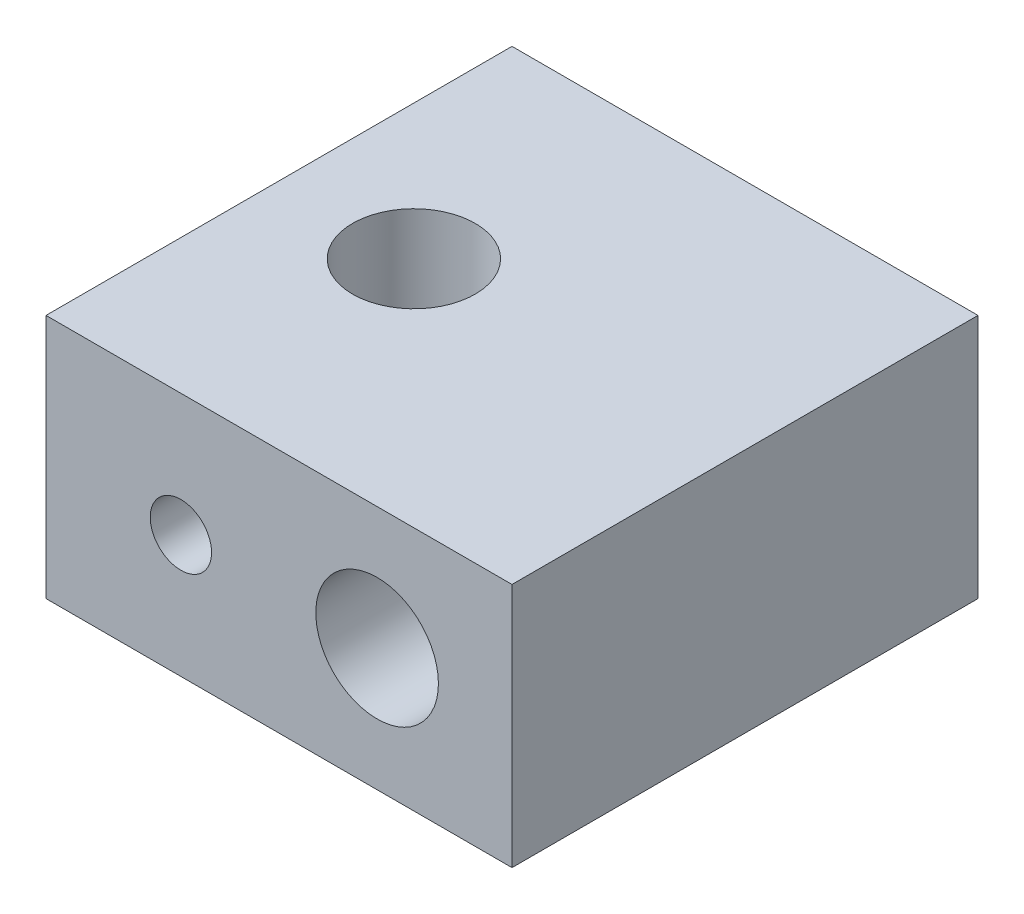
from build123d import *

# Parameters (mm, degrees)
SKETCH1_W           = 19
SKETCH1_H           = 19
BOSS_EXTRUDE1_DEPTH = 10
SKETCH2_R           = 2.5
CUT_EXTRUDE1_DEPTH  = 17.748134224
SKETCH3_R           = 1.25
CUT_EXTRUDE2_DEPTH  = 5
SKETCH4_R           = 2.5
CUT_EXTRUDE3_DEPTH  = 24.478713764
SKETCH5_R           = 3.25
CUT_EXTRUDE4_DEPTH  = 1.5
SKETCH6_R           = 1.25
CUT_EXTRUDE5_DEPTH  = 5


with BuildPart() as part:
    # Sketch1 → Boss-Extrude1 (new body)
    with BuildSketch(Plane(origin=(0, 0, 0), x_dir=(1, 0, 0), z_dir=(0, 1, 0))):
        Rectangle(SKETCH1_W, SKETCH1_H)
    extrude(amount=BOSS_EXTRUDE1_DEPTH)

    # Sketch2 → Cut-Extrude1 (cut, through all)
    with BuildSketch(Plane(origin=(0, 10, 0), x_dir=(1, 0, 0), z_dir=(0, 1, 0))):
        with Locations(Location((-4, 0, 0), (0, 0, 270))):
            Circle(SKETCH2_R)
    extrude(amount=-CUT_EXTRUDE1_DEPTH, mode=Mode.SUBTRACT)

    # Sketch3 → Cut-Extrude2 (cut)
    with BuildSketch(Plane.XY.offset(9.5)):
        with Locations((-4, 5)):
            Circle(SKETCH3_R)
    extrude(amount=-CUT_EXTRUDE2_DEPTH, mode=Mode.SUBTRACT)

    # Sketch4 → Cut-Extrude3 (cut, through all)
    with BuildSketch(Plane.XY.offset(9.5)):
        with Locations((4, 5)):
            Circle(SKETCH4_R)
    extrude(amount=-CUT_EXTRUDE3_DEPTH, mode=Mode.SUBTRACT)

    # Sketch5 → Cut-Extrude4 (cut)
    with BuildSketch(Plane.XZ):
        with Locations(Location((-4, 0, 0), (0, 0, 270))):
            Circle(SKETCH5_R)
    extrude(amount=-CUT_EXTRUDE4_DEPTH, mode=Mode.SUBTRACT)

    # Sketch6 → Cut-Extrude5 (cut)
    with BuildSketch(Plane.XZ):
        with Locations(Location((4, 0, 0), (0, 0, 270))):
            Circle(SKETCH6_R)
    extrude(amount=-CUT_EXTRUDE5_DEPTH, mode=Mode.SUBTRACT)


solid = part.part
